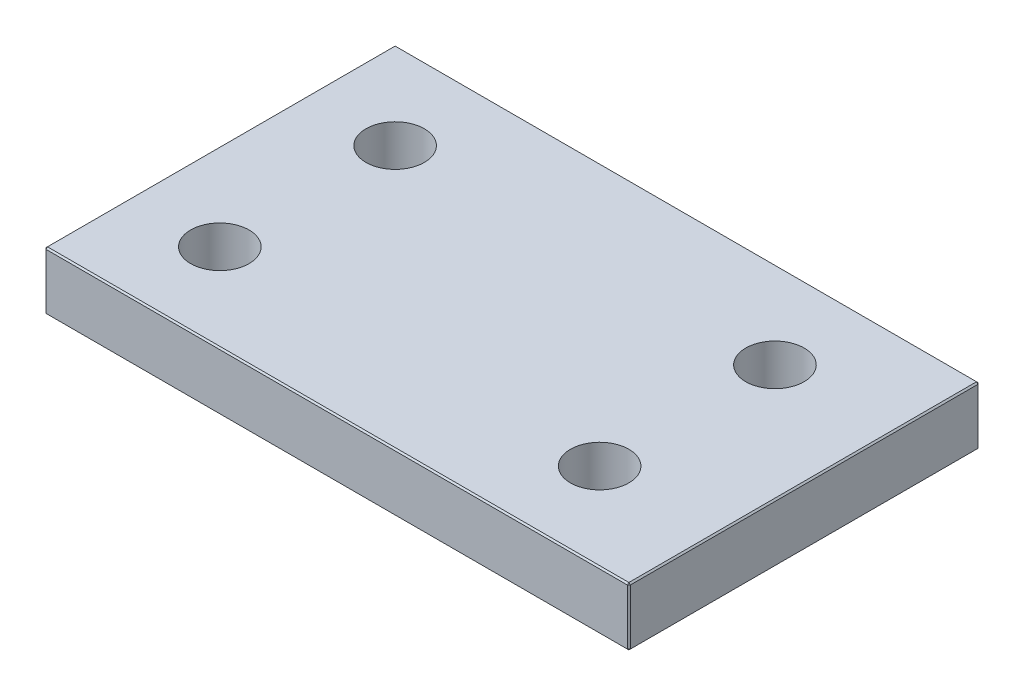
ISO-10303-21;
HEADER;
FILE_DESCRIPTION(('STEP AP214'),'2;1');
FILE_NAME('part.step','',(''),(''),'','','');
FILE_SCHEMA(('AUTOMOTIVE_DESIGN { 1 0 10303 214 1 1 1 1 }'));
ENDSEC;
DATA;
#1=APPLICATION_CONTEXT('core data for automotive mechanical design processes');
#2=APPLICATION_PROTOCOL_DEFINITION('international standard','automotive_design',2000,#1);
#3=PRODUCT_CONTEXT('',#1,'mechanical');
#4=PRODUCT('Part','Part','',(#3));
#5=PRODUCT_RELATED_PRODUCT_CATEGORY('part','',(#4));
#6=PRODUCT_DEFINITION_FORMATION('','',#4);
#7=PRODUCT_DEFINITION_CONTEXT('part definition',#1,'design');
#8=PRODUCT_DEFINITION('design','',#6,#7);
#9=PRODUCT_DEFINITION_SHAPE('','',#8);
#10=(LENGTH_UNIT() NAMED_UNIT(*) SI_UNIT(.MILLI.,.METRE.));
#11=(NAMED_UNIT(*) PLANE_ANGLE_UNIT() SI_UNIT($,.RADIAN.));
#12=(NAMED_UNIT(*) SI_UNIT($,.STERADIAN.) SOLID_ANGLE_UNIT());
#13=UNCERTAINTY_MEASURE_WITH_UNIT(LENGTH_MEASURE(1.E-05),#10,'distance_accuracy_value','');
#14=(GEOMETRIC_REPRESENTATION_CONTEXT(3) GLOBAL_UNCERTAINTY_ASSIGNED_CONTEXT((#13)) GLOBAL_UNIT_ASSIGNED_CONTEXT((#10,
#11,#12)) REPRESENTATION_CONTEXT('',''));
#15=CARTESIAN_POINT('',(0.,0.,0.));
#16=DIRECTION('',(0.,0.,1.));
#17=DIRECTION('',(1.,0.,0.));
#18=AXIS2_PLACEMENT_3D('',#15,#16,#17);
#19=CARTESIAN_POINT('',(-50.,10.,-30.));
#20=DIRECTION('',(1.,0.,0.));
#21=DIRECTION('',(0.,0.,-1.));
#22=AXIS2_PLACEMENT_3D('',#19,#20,#21);
#23=PLANE('',#22);
#24=DIRECTION('',(0.,0.,-1.));
#25=VECTOR('',#24,1.);
#26=CARTESIAN_POINT('',(-50.,9.75,-30.));
#27=LINE('',#26,#25);
#28=CARTESIAN_POINT('',(-50.,9.75,29.75));
#29=VERTEX_POINT('',#28);
#30=CARTESIAN_POINT('',(-50.,9.75,-29.75));
#31=VERTEX_POINT('',#30);
#32=EDGE_CURVE('E130',#29,#31,#27,.T.);
#33=ORIENTED_EDGE('',*,*,#32,.T.);
#34=DIRECTION('',(0.,-1.,0.));
#35=VECTOR('',#34,1.);
#36=CARTESIAN_POINT('',(-50.,10.,-29.75));
#37=LINE('',#36,#35);
#38=CARTESIAN_POINT('',(-50.,0.25,-29.75));
#39=VERTEX_POINT('',#38);
#40=EDGE_CURVE('E126',#31,#39,#37,.T.);
#41=ORIENTED_EDGE('',*,*,#40,.T.);
#42=DIRECTION('',(0.,0.,1.));
#43=VECTOR('',#42,1.);
#44=CARTESIAN_POINT('',(-50.,0.25,-30.));
#45=LINE('',#44,#43);
#46=CARTESIAN_POINT('',(-50.,0.25,29.75));
#47=VERTEX_POINT('',#46);
#48=EDGE_CURVE('E121',#39,#47,#45,.T.);
#49=ORIENTED_EDGE('',*,*,#48,.T.);
#50=DIRECTION('',(0.,1.,0.));
#51=VECTOR('',#50,1.);
#52=CARTESIAN_POINT('',(-50.,10.,29.75));
#53=LINE('',#52,#51);
#54=EDGE_CURVE('E123',#47,#29,#53,.T.);
#55=ORIENTED_EDGE('',*,*,#54,.T.);
#56=EDGE_LOOP('',(#33,#41,#49,#55));
#57=FACE_BOUND('',#56,.T.);
#58=ADVANCED_FACE('F32',(#57),#23,.F.);
#59=CARTESIAN_POINT('',(-50.,10.,30.));
#60=DIRECTION('',(0.,0.,-1.));
#61=DIRECTION('',(-1.,0.,0.));
#62=AXIS2_PLACEMENT_3D('',#59,#60,#61);
#63=PLANE('',#62);
#64=DIRECTION('',(-1.,0.,0.));
#65=VECTOR('',#64,1.);
#66=CARTESIAN_POINT('',(-50.,9.75,30.));
#67=LINE('',#66,#65);
#68=CARTESIAN_POINT('',(49.75,9.75,30.));
#69=VERTEX_POINT('',#68);
#70=CARTESIAN_POINT('',(-49.75,9.75,30.));
#71=VERTEX_POINT('',#70);
#72=EDGE_CURVE('E47',#69,#71,#67,.T.);
#73=ORIENTED_EDGE('',*,*,#72,.T.);
#74=DIRECTION('',(0.,-1.,0.));
#75=VECTOR('',#74,1.);
#76=CARTESIAN_POINT('',(-49.75,10.,30.));
#77=LINE('',#76,#75);
#78=CARTESIAN_POINT('',(-49.75,0.25,30.));
#79=VERTEX_POINT('',#78);
#80=EDGE_CURVE('E239',#71,#79,#77,.T.);
#81=ORIENTED_EDGE('',*,*,#80,.T.);
#82=DIRECTION('',(1.,0.,0.));
#83=VECTOR('',#82,1.);
#84=CARTESIAN_POINT('',(-50.,0.25,30.));
#85=LINE('',#84,#83);
#86=CARTESIAN_POINT('',(49.75,0.25,30.));
#87=VERTEX_POINT('',#86);
#88=EDGE_CURVE('E235',#79,#87,#85,.T.);
#89=ORIENTED_EDGE('',*,*,#88,.T.);
#90=DIRECTION('',(0.,1.,0.));
#91=VECTOR('',#90,1.);
#92=CARTESIAN_POINT('',(49.75,10.,30.));
#93=LINE('',#92,#91);
#94=EDGE_CURVE('E52',#87,#69,#93,.T.);
#95=ORIENTED_EDGE('',*,*,#94,.T.);
#96=EDGE_LOOP('',(#73,#81,#89,#95));
#97=FACE_BOUND('',#96,.T.);
#98=ADVANCED_FACE('F274',(#97),#63,.F.);
#99=CARTESIAN_POINT('',(50.,10.,-30.));
#100=DIRECTION('',(-1.,0.,0.));
#101=DIRECTION('',(0.,0.,1.));
#102=AXIS2_PLACEMENT_3D('',#99,#100,#101);
#103=PLANE('',#102);
#104=DIRECTION('',(0.,1.,0.));
#105=VECTOR('',#104,1.);
#106=CARTESIAN_POINT('',(50.,10.,-29.75));
#107=LINE('',#106,#105);
#108=CARTESIAN_POINT('',(50.,0.25,-29.75));
#109=VERTEX_POINT('',#108);
#110=CARTESIAN_POINT('',(50.,9.75,-29.75));
#111=VERTEX_POINT('',#110);
#112=EDGE_CURVE('E230',#109,#111,#107,.T.);
#113=ORIENTED_EDGE('',*,*,#112,.T.);
#114=DIRECTION('',(0.,0.,1.));
#115=VECTOR('',#114,1.);
#116=CARTESIAN_POINT('',(50.,9.75,30.));
#117=LINE('',#116,#115);
#118=CARTESIAN_POINT('',(50.,9.75,29.75));
#119=VERTEX_POINT('',#118);
#120=EDGE_CURVE('E232',#111,#119,#117,.T.);
#121=ORIENTED_EDGE('',*,*,#120,.T.);
#122=DIRECTION('',(0.,-1.,0.));
#123=VECTOR('',#122,1.);
#124=CARTESIAN_POINT('',(50.,10.,29.75));
#125=LINE('',#124,#123);
#126=CARTESIAN_POINT('',(50.,0.25,29.75));
#127=VERTEX_POINT('',#126);
#128=EDGE_CURVE('E226',#119,#127,#125,.T.);
#129=ORIENTED_EDGE('',*,*,#128,.T.);
#130=DIRECTION('',(0.,0.,-1.));
#131=VECTOR('',#130,1.);
#132=CARTESIAN_POINT('',(50.,0.25,-30.));
#133=LINE('',#132,#131);
#134=EDGE_CURVE('E228',#127,#109,#133,.T.);
#135=ORIENTED_EDGE('',*,*,#134,.T.);
#136=EDGE_LOOP('',(#113,#121,#129,#135));
#137=FACE_BOUND('',#136,.T.);
#138=ADVANCED_FACE('F268',(#137),#103,.F.);
#139=CARTESIAN_POINT('',(-50.,10.,-30.));
#140=DIRECTION('',(0.,0.,1.));
#141=DIRECTION('',(1.,0.,0.));
#142=AXIS2_PLACEMENT_3D('',#139,#140,#141);
#143=PLANE('',#142);
#144=DIRECTION('',(-1.,0.,0.));
#145=VECTOR('',#144,1.);
#146=CARTESIAN_POINT('',(-50.,0.25,-30.));
#147=LINE('',#146,#145);
#148=CARTESIAN_POINT('',(49.75,0.25,-30.));
#149=VERTEX_POINT('',#148);
#150=CARTESIAN_POINT('',(-49.75,0.25,-30.));
#151=VERTEX_POINT('',#150);
#152=EDGE_CURVE('E204',#149,#151,#147,.T.);
#153=ORIENTED_EDGE('',*,*,#152,.T.);
#154=DIRECTION('',(0.,1.,0.));
#155=VECTOR('',#154,1.);
#156=CARTESIAN_POINT('',(-49.75,10.,-30.));
#157=LINE('',#156,#155);
#158=CARTESIAN_POINT('',(-49.75,9.75,-30.));
#159=VERTEX_POINT('',#158);
#160=EDGE_CURVE('E206',#151,#159,#157,.T.);
#161=ORIENTED_EDGE('',*,*,#160,.T.);
#162=DIRECTION('',(1.,0.,0.));
#163=VECTOR('',#162,1.);
#164=CARTESIAN_POINT('',(50.,9.75,-30.));
#165=LINE('',#164,#163);
#166=CARTESIAN_POINT('',(49.75,9.75,-30.));
#167=VERTEX_POINT('',#166);
#168=EDGE_CURVE('E202',#159,#167,#165,.T.);
#169=ORIENTED_EDGE('',*,*,#168,.T.);
#170=DIRECTION('',(0.,-1.,0.));
#171=VECTOR('',#170,1.);
#172=CARTESIAN_POINT('',(49.75,10.,-30.));
#173=LINE('',#172,#171);
#174=EDGE_CURVE('E200',#167,#149,#173,.T.);
#175=ORIENTED_EDGE('',*,*,#174,.T.);
#176=EDGE_LOOP('',(#153,#161,#169,#175));
#177=FACE_BOUND('',#176,.T.);
#178=ADVANCED_FACE('F258',(#177),#143,.F.);
#179=CARTESIAN_POINT('',(-50.,10.,30.));
#180=DIRECTION('',(0.,1.,0.));
#181=DIRECTION('',(0.,0.,1.));
#182=AXIS2_PLACEMENT_3D('',#179,#180,#181);
#183=PLANE('',#182);
#184=CARTESIAN_POINT('',(30.,10.,15.));
#185=DIRECTION('',(0.,1.,0.));
#186=DIRECTION('',(0.,0.,1.));
#187=AXIS2_PLACEMENT_3D('',#184,#185,#186);
#188=CIRCLE('',#187,5.);
#189=CARTESIAN_POINT('',(30.,10.,20.));
#190=VERTEX_POINT('',#189);
#191=EDGE_CURVE('E413',#190,#190,#188,.T.);
#192=ORIENTED_EDGE('',*,*,#191,.F.);
#193=EDGE_LOOP('',(#192));
#194=FACE_BOUND('',#193,.T.);
#195=CARTESIAN_POINT('',(-35.,10.,15.));
#196=DIRECTION('',(0.,1.,0.));
#197=DIRECTION('',(0.,0.,1.));
#198=AXIS2_PLACEMENT_3D('',#195,#196,#197);
#199=CIRCLE('',#198,5.);
#200=CARTESIAN_POINT('',(-35.,10.,20.));
#201=VERTEX_POINT('',#200);
#202=EDGE_CURVE('E402',#201,#201,#199,.T.);
#203=ORIENTED_EDGE('',*,*,#202,.F.);
#204=EDGE_LOOP('',(#203));
#205=FACE_BOUND('',#204,.T.);
#206=DIRECTION('',(0.,0.,-1.));
#207=VECTOR('',#206,1.);
#208=CARTESIAN_POINT('',(49.75,10.,-30.));
#209=LINE('',#208,#207);
#210=CARTESIAN_POINT('',(49.75,10.,29.75));
#211=VERTEX_POINT('',#210);
#212=CARTESIAN_POINT('',(49.75,10.,-29.75));
#213=VERTEX_POINT('',#212);
#214=EDGE_CURVE('E219',#211,#213,#209,.T.);
#215=ORIENTED_EDGE('',*,*,#214,.T.);
#216=DIRECTION('',(-1.,0.,0.));
#217=VECTOR('',#216,1.);
#218=CARTESIAN_POINT('',(-50.,10.,-29.75));
#219=LINE('',#218,#217);
#220=CARTESIAN_POINT('',(-49.75,10.,-29.75));
#221=VERTEX_POINT('',#220);
#222=EDGE_CURVE('E223',#213,#221,#219,.T.);
#223=ORIENTED_EDGE('',*,*,#222,.T.);
#224=DIRECTION('',(0.,0.,1.));
#225=VECTOR('',#224,1.);
#226=CARTESIAN_POINT('',(-49.75,10.,30.));
#227=LINE('',#226,#225);
#228=CARTESIAN_POINT('',(-49.75,10.,29.75));
#229=VERTEX_POINT('',#228);
#230=EDGE_CURVE('E221',#221,#229,#227,.T.);
#231=ORIENTED_EDGE('',*,*,#230,.T.);
#232=DIRECTION('',(1.,0.,0.));
#233=VECTOR('',#232,1.);
#234=CARTESIAN_POINT('',(50.,10.,29.75));
#235=LINE('',#234,#233);
#236=EDGE_CURVE('E217',#229,#211,#235,.T.);
#237=ORIENTED_EDGE('',*,*,#236,.T.);
#238=EDGE_LOOP('',(#215,#223,#231,#237));
#239=FACE_BOUND('',#238,.T.);
#240=CARTESIAN_POINT('',(-35.,10.,-15.));
#241=DIRECTION('',(0.,1.,0.));
#242=DIRECTION('',(0.,0.,1.));
#243=AXIS2_PLACEMENT_3D('',#240,#241,#242);
#244=CIRCLE('',#243,5.);
#245=CARTESIAN_POINT('',(-35.,10.,-9.99999999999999));
#246=VERTEX_POINT('',#245);
#247=EDGE_CURVE('E244',#246,#246,#244,.T.);
#248=ORIENTED_EDGE('',*,*,#247,.F.);
#249=EDGE_LOOP('',(#248));
#250=FACE_BOUND('',#249,.T.);
#251=CARTESIAN_POINT('',(30.,10.,-15.));
#252=DIRECTION('',(0.,1.,0.));
#253=DIRECTION('',(0.,0.,1.));
#254=AXIS2_PLACEMENT_3D('',#251,#252,#253);
#255=CIRCLE('',#254,5.);
#256=CARTESIAN_POINT('',(30.,10.,-9.99999999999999));
#257=VERTEX_POINT('',#256);
#258=EDGE_CURVE('E11',#257,#257,#255,.T.);
#259=ORIENTED_EDGE('',*,*,#258,.F.);
#260=EDGE_LOOP('',(#259));
#261=FACE_BOUND('',#260,.T.);
#262=ADVANCED_FACE('F256',(#194,#205,#239,#250,#261),#183,.T.);
#263=CARTESIAN_POINT('',(-50.,0.,30.));
#264=DIRECTION('',(0.,1.,0.));
#265=DIRECTION('',(0.,0.,1.));
#266=AXIS2_PLACEMENT_3D('',#263,#264,#265);
#267=PLANE('',#266);
#268=CARTESIAN_POINT('',(30.,0.,15.));
#269=DIRECTION('',(0.,1.,0.));
#270=DIRECTION('',(0.,0.,1.));
#271=AXIS2_PLACEMENT_3D('',#268,#269,#270);
#272=CIRCLE('',#271,5.);
#273=CARTESIAN_POINT('',(30.,0.,20.));
#274=VERTEX_POINT('',#273);
#275=EDGE_CURVE('E416',#274,#274,#272,.T.);
#276=ORIENTED_EDGE('',*,*,#275,.T.);
#277=EDGE_LOOP('',(#276));
#278=FACE_BOUND('',#277,.T.);
#279=CARTESIAN_POINT('',(-35.,0.,15.));
#280=DIRECTION('',(0.,1.,0.));
#281=DIRECTION('',(0.,0.,1.));
#282=AXIS2_PLACEMENT_3D('',#279,#280,#281);
#283=CIRCLE('',#282,5.);
#284=CARTESIAN_POINT('',(-35.,0.,20.));
#285=VERTEX_POINT('',#284);
#286=EDGE_CURVE('E410',#285,#285,#283,.T.);
#287=ORIENTED_EDGE('',*,*,#286,.T.);
#288=EDGE_LOOP('',(#287));
#289=FACE_BOUND('',#288,.T.);
#290=DIRECTION('',(0.,0.,-1.));
#291=VECTOR('',#290,1.);
#292=CARTESIAN_POINT('',(-49.75,0.,30.));
#293=LINE('',#292,#291);
#294=CARTESIAN_POINT('',(-49.75,0.,29.75));
#295=VERTEX_POINT('',#294);
#296=CARTESIAN_POINT('',(-49.75,0.,-29.75));
#297=VERTEX_POINT('',#296);
#298=EDGE_CURVE('E152',#295,#297,#293,.T.);
#299=ORIENTED_EDGE('',*,*,#298,.T.);
#300=DIRECTION('',(1.,0.,0.));
#301=VECTOR('',#300,1.);
#302=CARTESIAN_POINT('',(-50.,0.,-29.75));
#303=LINE('',#302,#301);
#304=CARTESIAN_POINT('',(49.75,0.,-29.75));
#305=VERTEX_POINT('',#304);
#306=EDGE_CURVE('E214',#297,#305,#303,.T.);
#307=ORIENTED_EDGE('',*,*,#306,.T.);
#308=DIRECTION('',(0.,0.,1.));
#309=VECTOR('',#308,1.);
#310=CARTESIAN_POINT('',(49.75,0.,30.));
#311=LINE('',#310,#309);
#312=CARTESIAN_POINT('',(49.75,0.,29.75));
#313=VERTEX_POINT('',#312);
#314=EDGE_CURVE('E211',#305,#313,#311,.T.);
#315=ORIENTED_EDGE('',*,*,#314,.T.);
#316=DIRECTION('',(-1.,0.,0.));
#317=VECTOR('',#316,1.);
#318=CARTESIAN_POINT('',(-50.,0.,29.75));
#319=LINE('',#318,#317);
#320=EDGE_CURVE('E209',#313,#295,#319,.T.);
#321=ORIENTED_EDGE('',*,*,#320,.T.);
#322=EDGE_LOOP('',(#299,#307,#315,#321));
#323=FACE_BOUND('',#322,.T.);
#324=CARTESIAN_POINT('',(-35.,0.,-15.));
#325=DIRECTION('',(0.,1.,0.));
#326=DIRECTION('',(0.,0.,1.));
#327=AXIS2_PLACEMENT_3D('',#324,#325,#326);
#328=CIRCLE('',#327,5.);
#329=CARTESIAN_POINT('',(-35.,0.,-9.99999999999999));
#330=VERTEX_POINT('',#329);
#331=EDGE_CURVE('E241',#330,#330,#328,.T.);
#332=ORIENTED_EDGE('',*,*,#331,.T.);
#333=EDGE_LOOP('',(#332));
#334=FACE_BOUND('',#333,.T.);
#335=CARTESIAN_POINT('',(30.,0.,-15.));
#336=DIRECTION('',(0.,1.,0.));
#337=DIRECTION('',(0.,0.,1.));
#338=AXIS2_PLACEMENT_3D('',#335,#336,#337);
#339=CIRCLE('',#338,5.);
#340=CARTESIAN_POINT('',(30.,0.,-9.99999999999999));
#341=VERTEX_POINT('',#340);
#342=EDGE_CURVE('E40',#341,#341,#339,.T.);
#343=ORIENTED_EDGE('',*,*,#342,.T.);
#344=EDGE_LOOP('',(#343));
#345=FACE_BOUND('',#344,.T.);
#346=ADVANCED_FACE('F249',(#278,#289,#323,#334,#345),#267,.F.);
#347=CARTESIAN_POINT('',(50.,10.,29.75));
#348=DIRECTION('',(-0.707106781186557,0.,-0.707106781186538));
#349=DIRECTION('',(-0.707106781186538,0.,0.707106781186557));
#350=AXIS2_PLACEMENT_3D('',#347,#348,#349);
#351=PLANE('',#350);
#352=DIRECTION('',(-0.707106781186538,0.,0.707106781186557));
#353=VECTOR('',#352,1.);
#354=CARTESIAN_POINT('',(50.,9.75,29.75));
#355=LINE('',#354,#353);
#356=EDGE_CURVE('E141',#69,#119,#355,.F.);
#357=ORIENTED_EDGE('',*,*,#356,.F.);
#358=ORIENTED_EDGE('',*,*,#94,.F.);
#359=DIRECTION('',(0.707106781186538,0.,-0.707106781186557));
#360=VECTOR('',#359,1.);
#361=CARTESIAN_POINT('',(49.875,0.25,29.875));
#362=LINE('',#361,#360);
#363=EDGE_CURVE('E193',#127,#87,#362,.F.);
#364=ORIENTED_EDGE('',*,*,#363,.F.);
#365=ORIENTED_EDGE('',*,*,#128,.F.);
#366=EDGE_LOOP('',(#357,#358,#364,#365));
#367=FACE_BOUND('',#366,.T.);
#368=ADVANCED_FACE('F265',(#367),#351,.F.);
#369=CARTESIAN_POINT('',(50.,9.75,29.75));
#370=DIRECTION('',(0.577350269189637,0.577350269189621,0.577350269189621));
#371=DIRECTION('',(0.707106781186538,0.,-0.707106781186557));
#372=AXIS2_PLACEMENT_3D('',#369,#370,#371);
#373=PLANE('',#372);
#374=DIRECTION('',(0.,-0.707106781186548,0.707106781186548));
#375=VECTOR('',#374,1.);
#376=CARTESIAN_POINT('',(49.75,9.875,29.875));
#377=LINE('',#376,#375);
#378=EDGE_CURVE('E188',#69,#211,#377,.F.);
#379=ORIENTED_EDGE('',*,*,#378,.F.);
#380=ORIENTED_EDGE('',*,*,#356,.T.);
#381=DIRECTION('',(-0.707106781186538,0.707106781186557,0.));
#382=VECTOR('',#381,1.);
#383=CARTESIAN_POINT('',(50.,9.75,29.75));
#384=LINE('',#383,#382);
#385=EDGE_CURVE('E191',#211,#119,#384,.F.);
#386=ORIENTED_EDGE('',*,*,#385,.F.);
#387=EDGE_LOOP('',(#379,#380,#386));
#388=FACE_BOUND('',#387,.T.);
#389=ADVANCED_FACE('F368',(#388),#373,.T.);
#390=CARTESIAN_POINT('',(49.75,0.,29.75));
#391=DIRECTION('',(0.577350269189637,-0.577350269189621,0.577350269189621));
#392=DIRECTION('',(0.707106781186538,0.,-0.707106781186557));
#393=AXIS2_PLACEMENT_3D('',#390,#391,#392);
#394=PLANE('',#393);
#395=DIRECTION('',(-0.707106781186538,-0.707106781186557,0.));
#396=VECTOR('',#395,1.);
#397=CARTESIAN_POINT('',(49.75,0.,29.75));
#398=LINE('',#397,#396);
#399=EDGE_CURVE('E182',#127,#313,#398,.T.);
#400=ORIENTED_EDGE('',*,*,#399,.F.);
#401=ORIENTED_EDGE('',*,*,#363,.T.);
#402=DIRECTION('',(0.,0.707106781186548,0.707106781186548));
#403=VECTOR('',#402,1.);
#404=CARTESIAN_POINT('',(49.75,0.,29.75));
#405=LINE('',#404,#403);
#406=EDGE_CURVE('E185',#313,#87,#405,.T.);
#407=ORIENTED_EDGE('',*,*,#406,.F.);
#408=EDGE_LOOP('',(#400,#401,#407));
#409=FACE_BOUND('',#408,.T.);
#410=ADVANCED_FACE('F364',(#409),#394,.T.);
#411=CARTESIAN_POINT('',(49.75,10.,30.));
#412=DIRECTION('',(0.707106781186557,0.707106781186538,0.));
#413=DIRECTION('',(-0.707106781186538,0.707106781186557,0.));
#414=AXIS2_PLACEMENT_3D('',#411,#412,#413);
#415=PLANE('',#414);
#416=ORIENTED_EDGE('',*,*,#385,.T.);
#417=ORIENTED_EDGE('',*,*,#120,.F.);
#418=DIRECTION('',(0.707106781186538,-0.707106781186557,0.));
#419=VECTOR('',#418,1.);
#420=CARTESIAN_POINT('',(49.875,9.875,-29.75));
#421=LINE('',#420,#419);
#422=EDGE_CURVE('E176',#213,#111,#421,.T.);
#423=ORIENTED_EDGE('',*,*,#422,.F.);
#424=ORIENTED_EDGE('',*,*,#214,.F.);
#425=EDGE_LOOP('',(#416,#417,#423,#424));
#426=FACE_BOUND('',#425,.T.);
#427=ADVANCED_FACE('F360',(#426),#415,.T.);
#428=CARTESIAN_POINT('',(-50.,10.,29.75));
#429=DIRECTION('',(0.,0.707106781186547,0.707106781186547));
#430=DIRECTION('',(0.,-0.707106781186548,0.707106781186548));
#431=AXIS2_PLACEMENT_3D('',#428,#429,#430);
#432=PLANE('',#431);
#433=ORIENTED_EDGE('',*,*,#378,.T.);
#434=ORIENTED_EDGE('',*,*,#236,.F.);
#435=DIRECTION('',(0.,0.707106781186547,-0.707106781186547));
#436=VECTOR('',#435,1.);
#437=CARTESIAN_POINT('',(-49.75,10.,29.75));
#438=LINE('',#437,#436);
#439=EDGE_CURVE('E173',#71,#229,#438,.T.);
#440=ORIENTED_EDGE('',*,*,#439,.F.);
#441=ORIENTED_EDGE('',*,*,#72,.F.);
#442=EDGE_LOOP('',(#433,#434,#440,#441));
#443=FACE_BOUND('',#442,.T.);
#444=ADVANCED_FACE('F357',(#443),#432,.T.);
#445=CARTESIAN_POINT('',(-49.75,10.,30.));
#446=DIRECTION('',(0.707106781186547,0.,-0.707106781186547));
#447=DIRECTION('',(-0.707106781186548,0.,-0.707106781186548));
#448=AXIS2_PLACEMENT_3D('',#445,#446,#447);
#449=PLANE('',#448);
#450=DIRECTION('',(0.707106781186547,0.,0.707106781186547));
#451=VECTOR('',#450,1.);
#452=CARTESIAN_POINT('',(-50.,0.25,29.75));
#453=LINE('',#452,#451);
#454=EDGE_CURVE('E136',#79,#47,#453,.F.);
#455=ORIENTED_EDGE('',*,*,#454,.F.);
#456=ORIENTED_EDGE('',*,*,#80,.F.);
#457=DIRECTION('',(-0.707106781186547,0.,-0.707106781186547));
#458=VECTOR('',#457,1.);
#459=CARTESIAN_POINT('',(-49.875,9.75,29.875));
#460=LINE('',#459,#458);
#461=EDGE_CURVE('E139',#29,#71,#460,.F.);
#462=ORIENTED_EDGE('',*,*,#461,.F.);
#463=ORIENTED_EDGE('',*,*,#54,.F.);
#464=EDGE_LOOP('',(#455,#456,#462,#463));
#465=FACE_BOUND('',#464,.T.);
#466=ADVANCED_FACE('F135',(#465),#449,.F.);
#467=CARTESIAN_POINT('',(-50.,0.25,30.));
#468=DIRECTION('',(0.,0.707106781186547,-0.707106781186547));
#469=DIRECTION('',(0.,0.707106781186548,0.707106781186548));
#470=AXIS2_PLACEMENT_3D('',#467,#468,#469);
#471=PLANE('',#470);
#472=ORIENTED_EDGE('',*,*,#406,.T.);
#473=ORIENTED_EDGE('',*,*,#88,.F.);
#474=DIRECTION('',(0.,-0.707106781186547,-0.707106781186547));
#475=VECTOR('',#474,1.);
#476=CARTESIAN_POINT('',(-49.75,0.125,29.875));
#477=LINE('',#476,#475);
#478=EDGE_CURVE('E149',#295,#79,#477,.F.);
#479=ORIENTED_EDGE('',*,*,#478,.F.);
#480=ORIENTED_EDGE('',*,*,#320,.F.);
#481=EDGE_LOOP('',(#472,#473,#479,#480));
#482=FACE_BOUND('',#481,.T.);
#483=ADVANCED_FACE('F350',(#482),#471,.F.);
#484=CARTESIAN_POINT('',(50.,0.25,-30.));
#485=DIRECTION('',(-0.707106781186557,0.707106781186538,0.));
#486=DIRECTION('',(-0.707106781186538,-0.707106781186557,0.));
#487=AXIS2_PLACEMENT_3D('',#484,#485,#486);
#488=PLANE('',#487);
#489=ORIENTED_EDGE('',*,*,#399,.T.);
#490=ORIENTED_EDGE('',*,*,#314,.F.);
#491=DIRECTION('',(0.707106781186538,0.707106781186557,0.));
#492=VECTOR('',#491,1.);
#493=CARTESIAN_POINT('',(49.75,0.,-29.75));
#494=LINE('',#493,#492);
#495=EDGE_CURVE('E168',#109,#305,#494,.F.);
#496=ORIENTED_EDGE('',*,*,#495,.F.);
#497=ORIENTED_EDGE('',*,*,#134,.F.);
#498=EDGE_LOOP('',(#489,#490,#496,#497));
#499=FACE_BOUND('',#498,.T.);
#500=ADVANCED_FACE('F346',(#499),#488,.F.);
#501=CARTESIAN_POINT('',(49.75,10.,-30.));
#502=DIRECTION('',(-0.707106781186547,0.,0.707106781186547));
#503=DIRECTION('',(0.707106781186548,0.,0.707106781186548));
#504=AXIS2_PLACEMENT_3D('',#501,#502,#503);
#505=PLANE('',#504);
#506=DIRECTION('',(0.707106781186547,0.,0.707106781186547));
#507=VECTOR('',#506,1.);
#508=CARTESIAN_POINT('',(49.75,9.75,-30.));
#509=LINE('',#508,#507);
#510=EDGE_CURVE('E179',#111,#167,#509,.F.);
#511=ORIENTED_EDGE('',*,*,#510,.F.);
#512=ORIENTED_EDGE('',*,*,#112,.F.);
#513=DIRECTION('',(-0.707106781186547,0.,-0.707106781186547));
#514=VECTOR('',#513,1.);
#515=CARTESIAN_POINT('',(49.875,0.25,-29.875));
#516=LINE('',#515,#514);
#517=EDGE_CURVE('E165',#149,#109,#516,.F.);
#518=ORIENTED_EDGE('',*,*,#517,.F.);
#519=ORIENTED_EDGE('',*,*,#174,.F.);
#520=EDGE_LOOP('',(#511,#512,#518,#519));
#521=FACE_BOUND('',#520,.T.);
#522=ADVANCED_FACE('F342',(#521),#505,.F.);
#523=CARTESIAN_POINT('',(49.75,9.75,-30.));
#524=DIRECTION('',(0.577350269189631,0.577350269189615,-0.577350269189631));
#525=DIRECTION('',(-0.707106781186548,0.,-0.707106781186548));
#526=AXIS2_PLACEMENT_3D('',#523,#524,#525);
#527=PLANE('',#526);
#528=ORIENTED_EDGE('',*,*,#422,.T.);
#529=ORIENTED_EDGE('',*,*,#510,.T.);
#530=DIRECTION('',(0.,0.707106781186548,0.707106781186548));
#531=VECTOR('',#530,1.);
#532=CARTESIAN_POINT('',(49.75,9.75,-30.));
#533=LINE('',#532,#531);
#534=EDGE_CURVE('E157',#213,#167,#533,.F.);
#535=ORIENTED_EDGE('',*,*,#534,.F.);
#536=EDGE_LOOP('',(#528,#529,#535));
#537=FACE_BOUND('',#536,.T.);
#538=ADVANCED_FACE('F338',(#537),#527,.T.);
#539=CARTESIAN_POINT('',(-49.75,10.,29.75));
#540=DIRECTION('',(-0.577350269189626,0.577350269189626,0.577350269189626));
#541=DIRECTION('',(0.707106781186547,0.,0.707106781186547));
#542=AXIS2_PLACEMENT_3D('',#539,#540,#541);
#543=PLANE('',#542);
#544=ORIENTED_EDGE('',*,*,#461,.T.);
#545=ORIENTED_EDGE('',*,*,#439,.T.);
#546=DIRECTION('',(-0.707106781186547,-0.707106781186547,0.));
#547=VECTOR('',#546,1.);
#548=CARTESIAN_POINT('',(-49.75,10.,29.75));
#549=LINE('',#548,#547);
#550=EDGE_CURVE('E153',#29,#229,#549,.F.);
#551=ORIENTED_EDGE('',*,*,#550,.F.);
#552=EDGE_LOOP('',(#544,#545,#551));
#553=FACE_BOUND('',#552,.T.);
#554=ADVANCED_FACE('F335',(#553),#543,.T.);
#555=CARTESIAN_POINT('',(-50.,0.25,29.75));
#556=DIRECTION('',(-0.577350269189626,-0.577350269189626,0.577350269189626));
#557=DIRECTION('',(0.707106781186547,0.,0.707106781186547));
#558=AXIS2_PLACEMENT_3D('',#555,#556,#557);
#559=PLANE('',#558);
#560=ORIENTED_EDGE('',*,*,#478,.T.);
#561=ORIENTED_EDGE('',*,*,#454,.T.);
#562=DIRECTION('',(-0.707106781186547,0.707106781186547,0.));
#563=VECTOR('',#562,1.);
#564=CARTESIAN_POINT('',(-50.,0.25,29.75));
#565=LINE('',#564,#563);
#566=EDGE_CURVE('E146',#295,#47,#565,.T.);
#567=ORIENTED_EDGE('',*,*,#566,.F.);
#568=EDGE_LOOP('',(#560,#561,#567));
#569=FACE_BOUND('',#568,.T.);
#570=ADVANCED_FACE('F145',(#569),#559,.T.);
#571=CARTESIAN_POINT('',(49.75,0.,-29.75));
#572=DIRECTION('',(0.577350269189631,-0.577350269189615,-0.577350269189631));
#573=DIRECTION('',(-0.707106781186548,0.,-0.707106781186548));
#574=AXIS2_PLACEMENT_3D('',#571,#572,#573);
#575=PLANE('',#574);
#576=ORIENTED_EDGE('',*,*,#517,.T.);
#577=ORIENTED_EDGE('',*,*,#495,.T.);
#578=DIRECTION('',(0.,-0.707106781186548,0.707106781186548));
#579=VECTOR('',#578,1.);
#580=CARTESIAN_POINT('',(49.75,0.,-29.75));
#581=LINE('',#580,#579);
#582=EDGE_CURVE('E154',#149,#305,#581,.T.);
#583=ORIENTED_EDGE('',*,*,#582,.F.);
#584=EDGE_LOOP('',(#576,#577,#583));
#585=FACE_BOUND('',#584,.T.);
#586=ADVANCED_FACE('F328',(#585),#575,.T.);
#587=CARTESIAN_POINT('',(-50.,10.,-29.75));
#588=DIRECTION('',(0.,0.707106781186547,-0.707106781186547));
#589=DIRECTION('',(0.,0.707106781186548,0.707106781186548));
#590=AXIS2_PLACEMENT_3D('',#587,#588,#589);
#591=PLANE('',#590);
#592=ORIENTED_EDGE('',*,*,#534,.T.);
#593=ORIENTED_EDGE('',*,*,#168,.F.);
#594=DIRECTION('',(0.,-0.707106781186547,-0.707106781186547));
#595=VECTOR('',#594,1.);
#596=CARTESIAN_POINT('',(-49.75,9.75,-30.));
#597=LINE('',#596,#595);
#598=EDGE_CURVE('E159',#221,#159,#597,.T.);
#599=ORIENTED_EDGE('',*,*,#598,.F.);
#600=ORIENTED_EDGE('',*,*,#222,.F.);
#601=EDGE_LOOP('',(#592,#593,#599,#600));
#602=FACE_BOUND('',#601,.T.);
#603=ADVANCED_FACE('F324',(#602),#591,.T.);
#604=CARTESIAN_POINT('',(-49.75,10.,30.));
#605=DIRECTION('',(-0.707106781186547,0.707106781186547,0.));
#606=DIRECTION('',(-0.707106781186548,-0.707106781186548,0.));
#607=AXIS2_PLACEMENT_3D('',#604,#605,#606);
#608=PLANE('',#607);
#609=ORIENTED_EDGE('',*,*,#550,.T.);
#610=ORIENTED_EDGE('',*,*,#230,.F.);
#611=DIRECTION('',(0.707106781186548,0.707106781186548,0.));
#612=VECTOR('',#611,1.);
#613=CARTESIAN_POINT('',(-49.875,9.875,-29.75));
#614=LINE('',#613,#612);
#615=EDGE_CURVE('E387',#31,#221,#614,.T.);
#616=ORIENTED_EDGE('',*,*,#615,.F.);
#617=ORIENTED_EDGE('',*,*,#32,.F.);
#618=EDGE_LOOP('',(#609,#610,#616,#617));
#619=FACE_BOUND('',#618,.T.);
#620=ADVANCED_FACE('F321',(#619),#608,.T.);
#621=CARTESIAN_POINT('',(-50.,0.25,-30.));
#622=DIRECTION('',(0.707106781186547,0.707106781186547,0.));
#623=DIRECTION('',(-0.707106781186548,0.707106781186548,0.));
#624=AXIS2_PLACEMENT_3D('',#621,#622,#623);
#625=PLANE('',#624);
#626=ORIENTED_EDGE('',*,*,#566,.T.);
#627=ORIENTED_EDGE('',*,*,#48,.F.);
#628=DIRECTION('',(0.707106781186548,-0.707106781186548,0.));
#629=VECTOR('',#628,1.);
#630=CARTESIAN_POINT('',(-50.,0.25,-29.75));
#631=LINE('',#630,#629);
#632=EDGE_CURVE('E391',#297,#39,#631,.F.);
#633=ORIENTED_EDGE('',*,*,#632,.F.);
#634=ORIENTED_EDGE('',*,*,#298,.F.);
#635=EDGE_LOOP('',(#626,#627,#633,#634));
#636=FACE_BOUND('',#635,.T.);
#637=ADVANCED_FACE('F151',(#636),#625,.F.);
#638=CARTESIAN_POINT('',(-50.,0.25,-30.));
#639=DIRECTION('',(0.,0.707106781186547,0.707106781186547));
#640=DIRECTION('',(0.,-0.707106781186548,0.707106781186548));
#641=AXIS2_PLACEMENT_3D('',#638,#639,#640);
#642=PLANE('',#641);
#643=ORIENTED_EDGE('',*,*,#582,.T.);
#644=ORIENTED_EDGE('',*,*,#306,.F.);
#645=DIRECTION('',(0.,0.707106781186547,-0.707106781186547));
#646=VECTOR('',#645,1.);
#647=CARTESIAN_POINT('',(-49.75,0.125,-29.875));
#648=LINE('',#647,#646);
#649=EDGE_CURVE('E396',#151,#297,#648,.F.);
#650=ORIENTED_EDGE('',*,*,#649,.F.);
#651=ORIENTED_EDGE('',*,*,#152,.F.);
#652=EDGE_LOOP('',(#643,#644,#650,#651));
#653=FACE_BOUND('',#652,.T.);
#654=ADVANCED_FACE('F314',(#653),#642,.F.);
#655=CARTESIAN_POINT('',(-49.75,9.75,-30.));
#656=DIRECTION('',(-0.577350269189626,0.577350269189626,-0.577350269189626));
#657=DIRECTION('',(-0.707106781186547,0.,0.707106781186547));
#658=AXIS2_PLACEMENT_3D('',#655,#656,#657);
#659=PLANE('',#658);
#660=ORIENTED_EDGE('',*,*,#615,.T.);
#661=ORIENTED_EDGE('',*,*,#598,.T.);
#662=DIRECTION('',(0.707106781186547,0.,-0.707106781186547));
#663=VECTOR('',#662,1.);
#664=CARTESIAN_POINT('',(-49.75,9.75,-30.));
#665=LINE('',#664,#663);
#666=EDGE_CURVE('E393',#31,#159,#665,.T.);
#667=ORIENTED_EDGE('',*,*,#666,.F.);
#668=EDGE_LOOP('',(#660,#661,#667));
#669=FACE_BOUND('',#668,.T.);
#670=ADVANCED_FACE('F310',(#669),#659,.T.);
#671=CARTESIAN_POINT('',(-50.,0.25,-29.75));
#672=DIRECTION('',(-0.577350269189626,-0.577350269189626,-0.577350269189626));
#673=DIRECTION('',(-0.707106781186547,0.,0.707106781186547));
#674=AXIS2_PLACEMENT_3D('',#671,#672,#673);
#675=PLANE('',#674);
#676=ORIENTED_EDGE('',*,*,#649,.T.);
#677=ORIENTED_EDGE('',*,*,#632,.T.);
#678=DIRECTION('',(-0.707106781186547,0.,0.707106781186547));
#679=VECTOR('',#678,1.);
#680=CARTESIAN_POINT('',(-50.,0.25,-29.75));
#681=LINE('',#680,#679);
#682=EDGE_CURVE('E397',#151,#39,#681,.T.);
#683=ORIENTED_EDGE('',*,*,#682,.F.);
#684=EDGE_LOOP('',(#676,#677,#683));
#685=FACE_BOUND('',#684,.T.);
#686=ADVANCED_FACE('F306',(#685),#675,.T.);
#687=CARTESIAN_POINT('',(-50.,10.,-29.75));
#688=DIRECTION('',(0.707106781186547,0.,0.707106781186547));
#689=DIRECTION('',(0.707106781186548,0.,-0.707106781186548));
#690=AXIS2_PLACEMENT_3D('',#687,#688,#689);
#691=PLANE('',#690);
#692=ORIENTED_EDGE('',*,*,#666,.T.);
#693=ORIENTED_EDGE('',*,*,#160,.F.);
#694=ORIENTED_EDGE('',*,*,#682,.T.);
#695=ORIENTED_EDGE('',*,*,#40,.F.);
#696=EDGE_LOOP('',(#692,#693,#694,#695));
#697=FACE_BOUND('',#696,.T.);
#698=ADVANCED_FACE('F298',(#697),#691,.F.);
#699=CARTESIAN_POINT('',(-35.,10.,15.));
#700=DIRECTION('',(0.,1.,0.));
#701=DIRECTION('',(0.,0.,1.));
#702=AXIS2_PLACEMENT_3D('',#699,#700,#701);
#703=CYLINDRICAL_SURFACE('',#702,5.);
#704=ORIENTED_EDGE('',*,*,#286,.F.);
#705=EDGE_LOOP('',(#704));
#706=FACE_BOUND('',#705,.T.);
#707=ORIENTED_EDGE('',*,*,#202,.T.);
#708=EDGE_LOOP('',(#707));
#709=FACE_BOUND('',#708,.T.);
#710=ADVANCED_FACE('F287',(#706,#709),#703,.F.);
#711=CARTESIAN_POINT('',(30.,10.,15.));
#712=DIRECTION('',(0.,1.,0.));
#713=DIRECTION('',(0.,0.,1.));
#714=AXIS2_PLACEMENT_3D('',#711,#712,#713);
#715=CYLINDRICAL_SURFACE('',#714,5.);
#716=ORIENTED_EDGE('',*,*,#275,.F.);
#717=EDGE_LOOP('',(#716));
#718=FACE_BOUND('',#717,.T.);
#719=ORIENTED_EDGE('',*,*,#191,.T.);
#720=EDGE_LOOP('',(#719));
#721=FACE_BOUND('',#720,.T.);
#722=ADVANCED_FACE('F282',(#718,#721),#715,.F.);
#723=CARTESIAN_POINT('',(-35.,10.,-15.));
#724=DIRECTION('',(0.,1.,0.));
#725=DIRECTION('',(0.,0.,1.));
#726=AXIS2_PLACEMENT_3D('',#723,#724,#725);
#727=CYLINDRICAL_SURFACE('',#726,5.);
#728=ORIENTED_EDGE('',*,*,#331,.F.);
#729=EDGE_LOOP('',(#728));
#730=FACE_BOUND('',#729,.T.);
#731=ORIENTED_EDGE('',*,*,#247,.T.);
#732=EDGE_LOOP('',(#731));
#733=FACE_BOUND('',#732,.T.);
#734=ADVANCED_FACE('F253',(#730,#733),#727,.F.);
#735=CARTESIAN_POINT('',(30.,10.,-15.));
#736=DIRECTION('',(0.,1.,0.));
#737=DIRECTION('',(0.,0.,1.));
#738=AXIS2_PLACEMENT_3D('',#735,#736,#737);
#739=CYLINDRICAL_SURFACE('',#738,5.);
#740=ORIENTED_EDGE('',*,*,#342,.F.);
#741=EDGE_LOOP('',(#740));
#742=FACE_BOUND('',#741,.T.);
#743=ORIENTED_EDGE('',*,*,#258,.T.);
#744=EDGE_LOOP('',(#743));
#745=FACE_BOUND('',#744,.T.);
#746=ADVANCED_FACE('F34',(#742,#745),#739,.F.);
#747=CLOSED_SHELL('',(#58,#98,#138,#178,#262,#346,#368,#389,#410,#427,#444,#466,#483,#500,#522,
#538,#554,#570,#586,#603,#620,#637,#654,#670,#686,#698,#710,#722,#734,#746));
#748=MANIFOLD_SOLID_BREP('B2',#747);
#749=ADVANCED_BREP_SHAPE_REPRESENTATION('',(#18,#748),#14);
#750=SHAPE_DEFINITION_REPRESENTATION(#9,#749);
ENDSEC;
END-ISO-10303-21;
